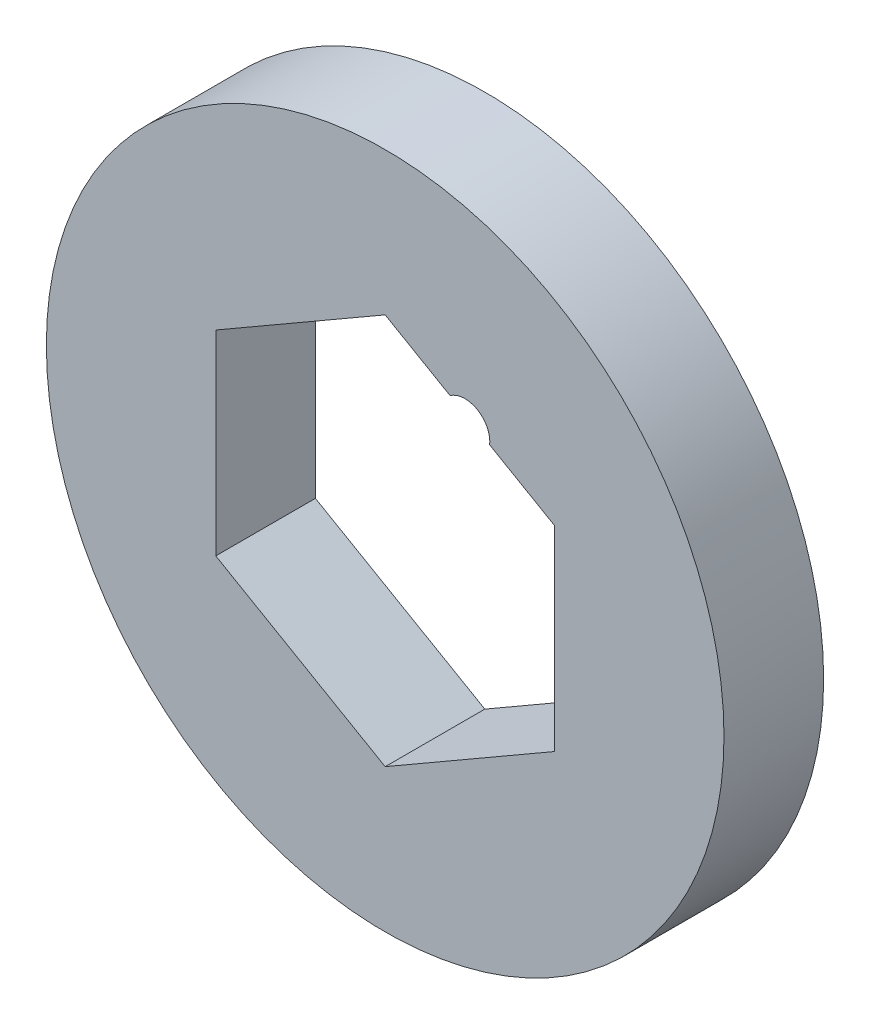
from build123d import *

# Parameters (mm, degrees)
ESQUISSE1_R             = 17
EXTRUSION1_DEPTH        = 5
ESQUISSE2_R             = 1.25
ENL_V_MAT_EXTRU_1_DEPTH = 25.556058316


with BuildPart() as part:
    # Esquisse1 → Extrusion1 (new body)
    with BuildSketch(Plane.XY):
        Circle(ESQUISSE1_R)
        Polygon((0, 9.814954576), (-8.5, 4.907477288), (-8.5, -4.907477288), (0, -9.814954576), (8.5, -4.907477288), (8.5, 4.907477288), align=None, mode=Mode.SUBTRACT)
    extrude(amount=EXTRUSION1_DEPTH)

    # Esquisse2 → Enl_v. mat.-Extru.1 (cut, through all)
    with BuildSketch(Plane.XY.offset(5)):
        with Locations((4, 6.92820323)):
            Circle(ESQUISSE2_R)
    extrude(amount=-ENL_V_MAT_EXTRU_1_DEPTH, mode=Mode.SUBTRACT)


solid = part.part
